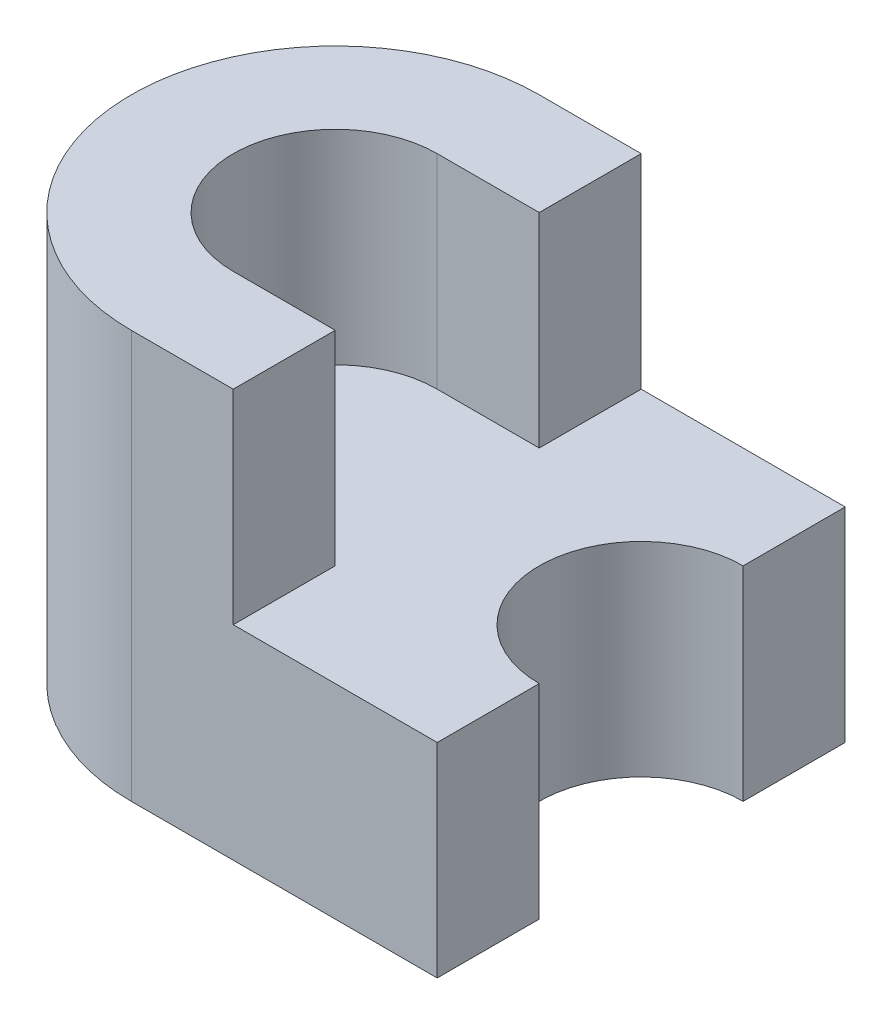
from build123d import *

# Parameters (mm, degrees)
EXTRUDE1_DEPTH      = 20
EXTRUDE_THIN1_DEPTH = 20
SKETCH3_R           = 10
EXTRUDE2_DEPTH      = 20


with BuildPart() as part:
    # Sketch1 → Extrude1 (new body)
    with BuildSketch(Plane(origin=(0, 0, 0), x_dir=(1, 0, 0), z_dir=(0, 1, 0))):
        with BuildLine():
            Line((0, 20), (30, 20))
            Line((30, 20), (30, -20))
            Line((30, -20), (0, -20))
            ThreePointArc((0, -20), (-20, 0), (0, 20))
        make_face()
    extrude(amount=EXTRUDE1_DEPTH)

    # Sketch2 → Extrude-Thin1 (add)
    with BuildSketch(Plane(origin=(0, 20, 0), x_dir=(1, 0, 0), z_dir=(0, 1, 0))):
        with BuildLine():
            Line((10, 20), (0, 20))
            ThreePointArc((0, 20), (-20, 0), (0, -20))
            Line((0, -20), (10, -20))
            Line((10, -20), (10, -10))
            Line((10, -10), (0, -10))
            ThreePointArc((0, -10), (-10, 0), (0, 10))
            Line((0, 10), (10, 10))
            Line((10, 10), (10, 20))
        make_face()
    extrude(amount=EXTRUDE_THIN1_DEPTH)

    # Sketch3 → Extrude2 (cut)
    with BuildSketch(Plane(origin=(0, 20, 0), x_dir=(1, 0, 0), z_dir=(0, 1, 0))):
        with Locations((30, 0)):
            Circle(SKETCH3_R)
    extrude(amount=-EXTRUDE2_DEPTH, mode=Mode.SUBTRACT)


solid = part.part
